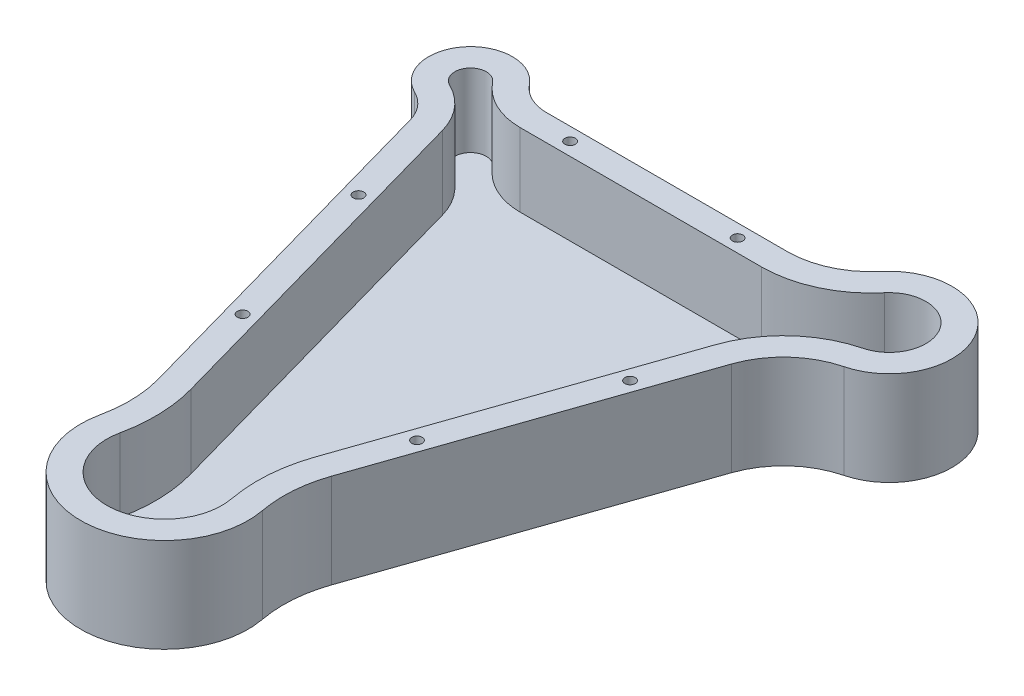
ISO-10303-21;
HEADER;
FILE_DESCRIPTION(('STEP AP214'),'2;1');
FILE_NAME('part.step','',(''),(''),'','','');
FILE_SCHEMA(('AUTOMOTIVE_DESIGN { 1 0 10303 214 1 1 1 1 }'));
ENDSEC;
DATA;
#1=APPLICATION_CONTEXT('core data for automotive mechanical design processes');
#2=APPLICATION_PROTOCOL_DEFINITION('international standard','automotive_design',2000,#1);
#3=PRODUCT_CONTEXT('',#1,'mechanical');
#4=PRODUCT('Part','Part','',(#3));
#5=PRODUCT_RELATED_PRODUCT_CATEGORY('part','',(#4));
#6=PRODUCT_DEFINITION_FORMATION('','',#4);
#7=PRODUCT_DEFINITION_CONTEXT('part definition',#1,'design');
#8=PRODUCT_DEFINITION('design','',#6,#7);
#9=PRODUCT_DEFINITION_SHAPE('','',#8);
#10=(LENGTH_UNIT() NAMED_UNIT(*) SI_UNIT(.MILLI.,.METRE.));
#11=(NAMED_UNIT(*) PLANE_ANGLE_UNIT() SI_UNIT($,.RADIAN.));
#12=(NAMED_UNIT(*) SI_UNIT($,.STERADIAN.) SOLID_ANGLE_UNIT());
#13=UNCERTAINTY_MEASURE_WITH_UNIT(LENGTH_MEASURE(1.E-05),#10,'distance_accuracy_value','');
#14=(GEOMETRIC_REPRESENTATION_CONTEXT(3) GLOBAL_UNCERTAINTY_ASSIGNED_CONTEXT((#13)) GLOBAL_UNIT_ASSIGNED_CONTEXT((#10,
#11,#12)) REPRESENTATION_CONTEXT('',''));
#15=CARTESIAN_POINT('',(0.,0.,0.));
#16=DIRECTION('',(0.,0.,1.));
#17=DIRECTION('',(1.,0.,0.));
#18=AXIS2_PLACEMENT_3D('',#15,#16,#17);
#19=CARTESIAN_POINT('',(-73.1240495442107,12.7,-133.363811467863));
#20=DIRECTION('',(0.,-1.,0.));
#21=DIRECTION('',(0.,0.,-1.));
#22=AXIS2_PLACEMENT_3D('',#19,#20,#21);
#23=CYLINDRICAL_SURFACE('',#22,25.4);
#24=CARTESIAN_POINT('',(-73.1240495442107,0.,-133.363811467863));
#25=DIRECTION('',(0.,-1.,0.));
#26=DIRECTION('',(0.,0.,1.));
#27=AXIS2_PLACEMENT_3D('',#24,#25,#26);
#28=CIRCLE('',#27,25.4);
#29=CARTESIAN_POINT('',(-73.1240495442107,0.,-107.963811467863));
#30=VERTEX_POINT('',#29);
#31=CARTESIAN_POINT('',(-92.9519181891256,0.,-117.488811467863));
#32=VERTEX_POINT('',#31);
#33=EDGE_CURVE('E467',#30,#32,#28,.T.);
#34=ORIENTED_EDGE('',*,*,#33,.T.);
#35=DIRECTION('',(0.,-1.,0.));
#36=VECTOR('',#35,1.);
#37=CARTESIAN_POINT('',(-92.9519181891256,12.7,-117.488811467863));
#38=LINE('',#37,#36);
#39=CARTESIAN_POINT('',(-92.9519181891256,57.15,-117.488811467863));
#40=VERTEX_POINT('',#39);
#41=EDGE_CURVE('E12',#40,#32,#38,.T.);
#42=ORIENTED_EDGE('',*,*,#41,.F.);
#43=CARTESIAN_POINT('',(-73.1240495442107,57.15,-133.363811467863));
#44=DIRECTION('',(0.,-1.,0.));
#45=DIRECTION('',(0.,0.,1.));
#46=AXIS2_PLACEMENT_3D('',#43,#44,#45);
#47=CIRCLE('',#46,25.4);
#48=CARTESIAN_POINT('',(-73.1240495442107,57.15,-107.963811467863));
#49=VERTEX_POINT('',#48);
#50=EDGE_CURVE('E464',#49,#40,#47,.T.);
#51=ORIENTED_EDGE('',*,*,#50,.F.);
#52=DIRECTION('',(0.,-1.,0.));
#53=VECTOR('',#52,1.);
#54=CARTESIAN_POINT('',(-73.1240495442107,12.7,-107.963811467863));
#55=LINE('',#54,#53);
#56=EDGE_CURVE('E492',#49,#30,#55,.T.);
#57=ORIENTED_EDGE('',*,*,#56,.T.);
#58=EDGE_LOOP('',(#34,#42,#51,#57));
#59=FACE_BOUND('',#58,.T.);
#60=ADVANCED_FACE('F98',(#59),#23,.F.);
#61=CARTESIAN_POINT('',(-112.77978683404,12.7,-101.613811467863));
#62=DIRECTION('',(0.,-1.,0.));
#63=DIRECTION('',(0.,0.,-1.));
#64=AXIS2_PLACEMENT_3D('',#61,#62,#63);
#65=CYLINDRICAL_SURFACE('',#64,25.4);
#66=CARTESIAN_POINT('',(-112.77978683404,0.,-101.613811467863));
#67=DIRECTION('',(0.,1.,0.));
#68=DIRECTION('',(0.,0.,-1.));
#69=AXIS2_PLACEMENT_3D('',#66,#67,#68);
#70=CIRCLE('',#69,25.4);
#71=CARTESIAN_POINT('',(-123.873001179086,0.,-78.7642907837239));
#72=VERTEX_POINT('',#71);
#73=EDGE_CURVE('E470',#32,#72,#70,.T.);
#74=ORIENTED_EDGE('',*,*,#73,.T.);
#75=DIRECTION('',(0.,-1.,0.));
#76=VECTOR('',#75,1.);
#77=CARTESIAN_POINT('',(-123.873001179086,12.7,-78.7642907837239));
#78=LINE('',#77,#76);
#79=CARTESIAN_POINT('',(-123.873001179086,57.15,-78.7642907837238));
#80=VERTEX_POINT('',#79);
#81=EDGE_CURVE('E105',#80,#72,#78,.T.);
#82=ORIENTED_EDGE('',*,*,#81,.F.);
#83=CARTESIAN_POINT('',(-112.77978683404,57.15,-101.613811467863));
#84=DIRECTION('',(0.,1.,0.));
#85=DIRECTION('',(0.,0.,1.));
#86=AXIS2_PLACEMENT_3D('',#83,#84,#85);
#87=CIRCLE('',#86,25.4);
#88=EDGE_CURVE('E431',#40,#80,#87,.T.);
#89=ORIENTED_EDGE('',*,*,#88,.F.);
#90=ORIENTED_EDGE('',*,*,#41,.T.);
#91=EDGE_LOOP('',(#74,#82,#89,#90));
#92=FACE_BOUND('',#91,.T.);
#93=ADVANCED_FACE('F572',(#92),#65,.T.);
#94=CARTESIAN_POINT('',(-134.966215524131,12.7,-55.9147700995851));
#95=DIRECTION('',(0.,-1.,0.));
#96=DIRECTION('',(0.,0.,-1.));
#97=AXIS2_PLACEMENT_3D('',#94,#95,#96);
#98=CYLINDRICAL_SURFACE('',#97,25.4);
#99=CARTESIAN_POINT('',(-134.966215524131,0.,-55.9147700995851));
#100=DIRECTION('',(0.,-1.,0.));
#101=DIRECTION('',(0.,0.,-1.));
#102=AXIS2_PLACEMENT_3D('',#99,#100,#101);
#103=CIRCLE('',#102,25.4);
#104=CARTESIAN_POINT('',(-110.513625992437,0.,-62.787241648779));
#105=VERTEX_POINT('',#104);
#106=EDGE_CURVE('E472',#72,#105,#103,.T.);
#107=ORIENTED_EDGE('',*,*,#106,.T.);
#108=DIRECTION('',(0.,-1.,0.));
#109=VECTOR('',#108,1.);
#110=CARTESIAN_POINT('',(-110.513625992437,12.7,-62.787241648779));
#111=LINE('',#110,#109);
#112=CARTESIAN_POINT('',(-110.513625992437,57.15,-62.787241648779));
#113=VERTEX_POINT('',#112);
#114=EDGE_CURVE('E519',#113,#105,#111,.T.);
#115=ORIENTED_EDGE('',*,*,#114,.F.);
#116=CARTESIAN_POINT('',(-134.966215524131,57.15,-55.9147700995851));
#117=DIRECTION('',(0.,-1.,0.));
#118=DIRECTION('',(0.,0.,1.));
#119=AXIS2_PLACEMENT_3D('',#116,#117,#118);
#120=CIRCLE('',#119,25.4);
#121=EDGE_CURVE('E434',#80,#113,#120,.T.);
#122=ORIENTED_EDGE('',*,*,#121,.F.);
#123=ORIENTED_EDGE('',*,*,#81,.T.);
#124=EDGE_LOOP('',(#107,#115,#122,#123));
#125=FACE_BOUND('',#124,.T.);
#126=ADVANCED_FACE('F525',(#125),#98,.F.);
#127=CARTESIAN_POINT('',(-110.513625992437,12.7,-62.787241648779));
#128=DIRECTION('',(0.962700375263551,0.,-0.270569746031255));
#129=DIRECTION('',(-0.270569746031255,0.,-0.962700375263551));
#130=AXIS2_PLACEMENT_3D('',#127,#128,#129);
#131=PLANE('',#130);
#132=DIRECTION('',(0.270569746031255,0.,0.962700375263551));
#133=VECTOR('',#132,1.);
#134=CARTESIAN_POINT('',(-110.513625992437,0.,-62.787241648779));
#135=LINE('',#134,#133);
#136=CARTESIAN_POINT('',(-50.8180578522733,0.,149.612506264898));
#137=VERTEX_POINT('',#136);
#138=EDGE_CURVE('E474',#105,#137,#135,.T.);
#139=ORIENTED_EDGE('',*,*,#138,.T.);
#140=DIRECTION('',(0.,-1.,0.));
#141=VECTOR('',#140,1.);
#142=CARTESIAN_POINT('',(-50.8180578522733,12.7,149.612506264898));
#143=LINE('',#142,#141);
#144=CARTESIAN_POINT('',(-50.8180578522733,57.15,149.612506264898));
#145=VERTEX_POINT('',#144);
#146=EDGE_CURVE('E516',#145,#137,#143,.T.);
#147=ORIENTED_EDGE('',*,*,#146,.F.);
#148=DIRECTION('',(0.270569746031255,0.,0.962700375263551));
#149=VECTOR('',#148,1.);
#150=CARTESIAN_POINT('',(-110.513625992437,57.15,-62.787241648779));
#151=LINE('',#150,#149);
#152=EDGE_CURVE('E437',#113,#145,#151,.T.);
#153=ORIENTED_EDGE('',*,*,#152,.F.);
#154=ORIENTED_EDGE('',*,*,#114,.T.);
#155=EDGE_LOOP('',(#139,#147,#153,#154));
#156=FACE_BOUND('',#155,.T.);
#157=ADVANCED_FACE('F535',(#156),#131,.F.);
#158=CARTESIAN_POINT('',(-124.175826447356,12.7,170.229920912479));
#159=DIRECTION('',(0.,-1.,0.));
#160=DIRECTION('',(0.,0.,-1.));
#161=AXIS2_PLACEMENT_3D('',#158,#159,#160);
#162=CYLINDRICAL_SURFACE('',#161,76.2);
#163=CARTESIAN_POINT('',(-124.175826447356,0.,170.229920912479));
#164=DIRECTION('',(0.,-1.,0.));
#165=DIRECTION('',(0.,0.,1.));
#166=AXIS2_PLACEMENT_3D('',#163,#164,#165);
#167=CIRCLE('',#166,76.2);
#168=CARTESIAN_POINT('',(-49.6703305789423,0.,186.210255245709));
#169=VERTEX_POINT('',#168);
#170=EDGE_CURVE('E476',#137,#169,#167,.T.);
#171=ORIENTED_EDGE('',*,*,#170,.T.);
#172=DIRECTION('',(0.,-1.,0.));
#173=VECTOR('',#172,1.);
#174=CARTESIAN_POINT('',(-49.6703305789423,12.7,186.210255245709));
#175=LINE('',#174,#173);
#176=CARTESIAN_POINT('',(-49.6703305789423,57.15,186.210255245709));
#177=VERTEX_POINT('',#176);
#178=EDGE_CURVE('E513',#177,#169,#175,.T.);
#179=ORIENTED_EDGE('',*,*,#178,.F.);
#180=CARTESIAN_POINT('',(-124.175826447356,57.15,170.229920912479));
#181=DIRECTION('',(0.,-1.,0.));
#182=DIRECTION('',(0.,0.,1.));
#183=AXIS2_PLACEMENT_3D('',#180,#181,#182);
#184=CIRCLE('',#183,76.2);
#185=EDGE_CURVE('E440',#145,#177,#184,.T.);
#186=ORIENTED_EDGE('',*,*,#185,.F.);
#187=ORIENTED_EDGE('',*,*,#146,.T.);
#188=EDGE_LOOP('',(#171,#179,#186,#187));
#189=FACE_BOUND('',#188,.T.);
#190=ADVANCED_FACE('F539',(#189),#162,.F.);
#191=CARTESIAN_POINT('',(0.,12.7,196.863811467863));
#192=DIRECTION('',(0.,-1.,0.));
#193=DIRECTION('',(0.,0.,-1.));
#194=AXIS2_PLACEMENT_3D('',#191,#192,#193);
#195=CYLINDRICAL_SURFACE('',#194,50.8);
#196=CARTESIAN_POINT('',(0.,0.,196.863811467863));
#197=DIRECTION('',(0.,1.,0.));
#198=DIRECTION('',(0.,0.,-1.));
#199=AXIS2_PLACEMENT_3D('',#196,#197,#198);
#200=CIRCLE('',#199,50.8);
#201=CARTESIAN_POINT('',(49.9084233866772,0.,187.388091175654));
#202=VERTEX_POINT('',#201);
#203=EDGE_CURVE('E478',#169,#202,#200,.T.);
#204=ORIENTED_EDGE('',*,*,#203,.T.);
#205=DIRECTION('',(0.,-1.,0.));
#206=VECTOR('',#205,1.);
#207=CARTESIAN_POINT('',(49.9084233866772,12.7,187.388091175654));
#208=LINE('',#207,#206);
#209=CARTESIAN_POINT('',(49.9084233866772,57.15,187.388091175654));
#210=VERTEX_POINT('',#209);
#211=EDGE_CURVE('E510',#210,#202,#208,.T.);
#212=ORIENTED_EDGE('',*,*,#211,.F.);
#213=CARTESIAN_POINT('',(0.,57.15,196.863811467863));
#214=DIRECTION('',(0.,1.,0.));
#215=DIRECTION('',(0.,0.,1.));
#216=AXIS2_PLACEMENT_3D('',#213,#214,#215);
#217=CIRCLE('',#216,50.8);
#218=EDGE_CURVE('E443',#177,#210,#217,.T.);
#219=ORIENTED_EDGE('',*,*,#218,.F.);
#220=ORIENTED_EDGE('',*,*,#178,.T.);
#221=EDGE_LOOP('',(#204,#212,#219,#220));
#222=FACE_BOUND('',#221,.T.);
#223=ADVANCED_FACE('F546',(#222),#195,.T.);
#224=CARTESIAN_POINT('',(124.771058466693,12.7,173.174510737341));
#225=DIRECTION('',(0.,-1.,0.));
#226=DIRECTION('',(0.,0.,-1.));
#227=AXIS2_PLACEMENT_3D('',#224,#225,#226);
#228=CYLINDRICAL_SURFACE('',#227,76.2);
#229=CARTESIAN_POINT('',(124.771058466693,0.,173.174510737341));
#230=DIRECTION('',(0.,-1.,0.));
#231=DIRECTION('',(0.,0.,-1.));
#232=AXIS2_PLACEMENT_3D('',#229,#230,#231);
#233=CIRCLE('',#232,76.2);
#234=CARTESIAN_POINT('',(52.7611943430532,0.,148.254248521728));
#235=VERTEX_POINT('',#234);
#236=EDGE_CURVE('E480',#202,#235,#233,.T.);
#237=ORIENTED_EDGE('',*,*,#236,.T.);
#238=DIRECTION('',(0.,-1.,0.));
#239=VECTOR('',#238,1.);
#240=CARTESIAN_POINT('',(52.7611943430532,12.7,148.254248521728));
#241=LINE('',#240,#239);
#242=CARTESIAN_POINT('',(52.7611943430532,57.15,148.254248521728));
#243=VERTEX_POINT('',#242);
#244=EDGE_CURVE('E507',#243,#235,#241,.T.);
#245=ORIENTED_EDGE('',*,*,#244,.F.);
#246=CARTESIAN_POINT('',(124.771058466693,57.15,173.174510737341));
#247=DIRECTION('',(0.,-1.,0.));
#248=DIRECTION('',(0.,0.,1.));
#249=AXIS2_PLACEMENT_3D('',#246,#247,#248);
#250=CIRCLE('',#249,76.2);
#251=EDGE_CURVE('E446',#210,#243,#250,.T.);
#252=ORIENTED_EDGE('',*,*,#251,.F.);
#253=ORIENTED_EDGE('',*,*,#211,.T.);
#254=EDGE_LOOP('',(#237,#245,#252,#253));
#255=FACE_BOUND('',#254,.T.);
#256=ADVANCED_FACE('F549',(#255),#228,.F.);
#257=CARTESIAN_POINT('',(52.7611943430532,12.7,148.254248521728));
#258=DIRECTION('',(-0.945011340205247,0.,-0.32703756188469));
#259=DIRECTION('',(-0.32703756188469,0.,0.945011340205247));
#260=AXIS2_PLACEMENT_3D('',#257,#258,#259);
#261=PLANE('',#260);
#262=DIRECTION('',(0.32703756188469,0.,-0.945011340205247));
#263=VECTOR('',#262,1.);
#264=CARTESIAN_POINT('',(52.7611943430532,0.,148.254248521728));
#265=LINE('',#264,#263);
#266=CARTESIAN_POINT('',(115.169402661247,0.,-32.0811974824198));
#267=VERTEX_POINT('',#266);
#268=EDGE_CURVE('E482',#235,#267,#265,.T.);
#269=ORIENTED_EDGE('',*,*,#268,.T.);
#270=DIRECTION('',(0.,-1.,0.));
#271=VECTOR('',#270,1.);
#272=CARTESIAN_POINT('',(115.169402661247,12.7,-32.0811974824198));
#273=LINE('',#272,#271);
#274=CARTESIAN_POINT('',(115.169402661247,57.15,-32.0811974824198));
#275=VERTEX_POINT('',#274);
#276=EDGE_CURVE('E504',#275,#267,#273,.T.);
#277=ORIENTED_EDGE('',*,*,#276,.F.);
#278=DIRECTION('',(0.32703756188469,0.,-0.945011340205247));
#279=VECTOR('',#278,1.);
#280=CARTESIAN_POINT('',(52.7611943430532,57.15,148.254248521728));
#281=LINE('',#280,#279);
#282=EDGE_CURVE('E449',#243,#275,#281,.T.);
#283=ORIENTED_EDGE('',*,*,#282,.F.);
#284=ORIENTED_EDGE('',*,*,#244,.T.);
#285=EDGE_LOOP('',(#269,#277,#283,#284));
#286=FACE_BOUND('',#285,.T.);
#287=ADVANCED_FACE('F554',(#286),#261,.F.);
#288=CARTESIAN_POINT('',(163.175978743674,12.7,-15.4676893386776));
#289=DIRECTION('',(0.,-1.,0.));
#290=DIRECTION('',(0.,0.,-1.));
#291=AXIS2_PLACEMENT_3D('',#288,#289,#290);
#292=CYLINDRICAL_SURFACE('',#291,50.8);
#293=CARTESIAN_POINT('',(163.175978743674,0.,-15.4676893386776));
#294=DIRECTION('',(0.,-1.,0.));
#295=DIRECTION('',(0.,0.,1.));
#296=AXIS2_PLACEMENT_3D('',#293,#294,#295);
#297=CIRCLE('',#296,50.8);
#298=CARTESIAN_POINT('',(150.62982698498,0.,-64.694044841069));
#299=VERTEX_POINT('',#298);
#300=EDGE_CURVE('E484',#267,#299,#297,.T.);
#301=ORIENTED_EDGE('',*,*,#300,.T.);
#302=DIRECTION('',(0.,-1.,0.));
#303=VECTOR('',#302,1.);
#304=CARTESIAN_POINT('',(150.62982698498,12.7,-64.694044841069));
#305=LINE('',#304,#303);
#306=CARTESIAN_POINT('',(150.62982698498,57.15,-64.694044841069));
#307=VERTEX_POINT('',#306);
#308=EDGE_CURVE('E501',#307,#299,#305,.T.);
#309=ORIENTED_EDGE('',*,*,#308,.F.);
#310=CARTESIAN_POINT('',(163.175978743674,57.15,-15.4676893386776));
#311=DIRECTION('',(0.,-1.,0.));
#312=DIRECTION('',(0.,0.,1.));
#313=AXIS2_PLACEMENT_3D('',#310,#311,#312);
#314=CIRCLE('',#313,50.8);
#315=EDGE_CURVE('E452',#275,#307,#314,.T.);
#316=ORIENTED_EDGE('',*,*,#315,.F.);
#317=ORIENTED_EDGE('',*,*,#276,.T.);
#318=EDGE_LOOP('',(#301,#309,#316,#317));
#319=FACE_BOUND('',#318,.T.);
#320=ADVANCED_FACE('F558',(#319),#292,.F.);
#321=CARTESIAN_POINT('',(141.22021316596,12.7,-101.613811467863));
#322=DIRECTION('',(0.,-1.,0.));
#323=DIRECTION('',(0.,0.,-1.));
#324=AXIS2_PLACEMENT_3D('',#321,#322,#323);
#325=CYLINDRICAL_SURFACE('',#324,38.1);
#326=CARTESIAN_POINT('',(141.22021316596,0.,-101.613811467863));
#327=DIRECTION('',(0.,1.,0.));
#328=DIRECTION('',(0.,0.,1.));
#329=AXIS2_PLACEMENT_3D('',#326,#327,#328);
#330=CIRCLE('',#329,38.1);
#331=CARTESIAN_POINT('',(112.036143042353,0.,-126.10666861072));
#332=VERTEX_POINT('',#331);
#333=EDGE_CURVE('E486',#299,#332,#330,.T.);
#334=ORIENTED_EDGE('',*,*,#333,.T.);
#335=DIRECTION('',(0.,-1.,0.));
#336=VECTOR('',#335,1.);
#337=CARTESIAN_POINT('',(112.036143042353,12.7,-126.10666861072));
#338=LINE('',#337,#336);
#339=CARTESIAN_POINT('',(112.036143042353,57.15,-126.10666861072));
#340=VERTEX_POINT('',#339);
#341=EDGE_CURVE('E498',#340,#332,#338,.T.);
#342=ORIENTED_EDGE('',*,*,#341,.F.);
#343=CARTESIAN_POINT('',(141.22021316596,57.15,-101.613811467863));
#344=DIRECTION('',(0.,1.,0.));
#345=DIRECTION('',(0.,0.,1.));
#346=AXIS2_PLACEMENT_3D('',#343,#344,#345);
#347=CIRCLE('',#346,38.1);
#348=EDGE_CURVE('E455',#307,#340,#347,.T.);
#349=ORIENTED_EDGE('',*,*,#348,.F.);
#350=ORIENTED_EDGE('',*,*,#308,.T.);
#351=EDGE_LOOP('',(#334,#342,#349,#350));
#352=FACE_BOUND('',#351,.T.);
#353=ADVANCED_FACE('F562',(#352),#325,.T.);
#354=CARTESIAN_POINT('',(73.1240495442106,12.7,-158.763811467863));
#355=DIRECTION('',(0.,-1.,0.));
#356=DIRECTION('',(0.,0.,-1.));
#357=AXIS2_PLACEMENT_3D('',#354,#355,#356);
#358=CYLINDRICAL_SURFACE('',#357,50.8);
#359=CARTESIAN_POINT('',(73.1240495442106,0.,-158.763811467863));
#360=DIRECTION('',(0.,-1.,0.));
#361=DIRECTION('',(0.,0.,-1.));
#362=AXIS2_PLACEMENT_3D('',#359,#360,#361);
#363=CIRCLE('',#362,50.8);
#364=CARTESIAN_POINT('',(73.1240495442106,0.,-107.963811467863));
#365=VERTEX_POINT('',#364);
#366=EDGE_CURVE('E488',#332,#365,#363,.T.);
#367=ORIENTED_EDGE('',*,*,#366,.T.);
#368=DIRECTION('',(0.,-1.,0.));
#369=VECTOR('',#368,1.);
#370=CARTESIAN_POINT('',(73.1240495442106,12.7,-107.963811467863));
#371=LINE('',#370,#369);
#372=CARTESIAN_POINT('',(73.1240495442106,57.15,-107.963811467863));
#373=VERTEX_POINT('',#372);
#374=EDGE_CURVE('E495',#373,#365,#371,.T.);
#375=ORIENTED_EDGE('',*,*,#374,.F.);
#376=CARTESIAN_POINT('',(73.1240495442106,57.15,-158.763811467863));
#377=DIRECTION('',(0.,-1.,0.));
#378=DIRECTION('',(0.,0.,1.));
#379=AXIS2_PLACEMENT_3D('',#376,#377,#378);
#380=CIRCLE('',#379,50.8);
#381=EDGE_CURVE('E458',#340,#373,#380,.T.);
#382=ORIENTED_EDGE('',*,*,#381,.F.);
#383=ORIENTED_EDGE('',*,*,#341,.T.);
#384=EDGE_LOOP('',(#367,#375,#382,#383));
#385=FACE_BOUND('',#384,.T.);
#386=ADVANCED_FACE('F565',(#385),#358,.F.);
#387=CARTESIAN_POINT('',(73.1240495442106,12.7,-107.963811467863));
#388=DIRECTION('',(0.,0.,1.));
#389=DIRECTION('',(1.,0.,0.));
#390=AXIS2_PLACEMENT_3D('',#387,#388,#389);
#391=PLANE('',#390);
#392=DIRECTION('',(-1.,0.,0.));
#393=VECTOR('',#392,1.);
#394=CARTESIAN_POINT('',(73.1240495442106,0.,-107.963811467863));
#395=LINE('',#394,#393);
#396=EDGE_CURVE('E490',#365,#30,#395,.T.);
#397=ORIENTED_EDGE('',*,*,#396,.T.);
#398=ORIENTED_EDGE('',*,*,#56,.F.);
#399=DIRECTION('',(-1.,0.,0.));
#400=VECTOR('',#399,1.);
#401=CARTESIAN_POINT('',(73.1240495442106,57.15,-107.963811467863));
#402=LINE('',#401,#400);
#403=EDGE_CURVE('E461',#373,#49,#402,.T.);
#404=ORIENTED_EDGE('',*,*,#403,.F.);
#405=ORIENTED_EDGE('',*,*,#374,.T.);
#406=EDGE_LOOP('',(#397,#398,#404,#405));
#407=FACE_BOUND('',#406,.T.);
#408=ADVANCED_FACE('F568',(#407),#391,.F.);
#409=CARTESIAN_POINT('',(-73.1240495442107,0.,-133.363811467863));
#410=DIRECTION('',(0.,1.,0.));
#411=DIRECTION('',(0.,0.,1.));
#412=AXIS2_PLACEMENT_3D('',#409,#410,#411);
#413=PLANE('',#412);
#414=ORIENTED_EDGE('',*,*,#33,.F.);
#415=ORIENTED_EDGE('',*,*,#396,.F.);
#416=ORIENTED_EDGE('',*,*,#366,.F.);
#417=ORIENTED_EDGE('',*,*,#333,.F.);
#418=ORIENTED_EDGE('',*,*,#300,.F.);
#419=ORIENTED_EDGE('',*,*,#268,.F.);
#420=ORIENTED_EDGE('',*,*,#236,.F.);
#421=ORIENTED_EDGE('',*,*,#203,.F.);
#422=ORIENTED_EDGE('',*,*,#170,.F.);
#423=ORIENTED_EDGE('',*,*,#138,.F.);
#424=ORIENTED_EDGE('',*,*,#106,.F.);
#425=ORIENTED_EDGE('',*,*,#73,.F.);
#426=EDGE_LOOP('',(#414,#415,#416,#417,#418,#419,#420,#421,#422,#423,#424,#425));
#427=FACE_BOUND('',#426,.T.);
#428=ADVANCED_FACE('F531',(#427),#413,.F.);
#429=CARTESIAN_POINT('',(-112.77978683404,57.15,-101.613811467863));
#430=DIRECTION('',(0.,1.,0.));
#431=DIRECTION('',(0.,0.,1.));
#432=AXIS2_PLACEMENT_3D('',#429,#430,#431);
#433=PLANE('',#432);
#434=CARTESIAN_POINT('',(-50.8,57.15,-100.026311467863));
#435=DIRECTION('',(0.,1.,0.));
#436=DIRECTION('',(0.,0.,1.));
#437=AXIS2_PLACEMENT_3D('',#434,#435,#436);
#438=CIRCLE('',#437,3.175);
#439=CARTESIAN_POINT('',(-50.8,57.15,-96.8513114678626));
#440=VERTEX_POINT('',#439);
#441=EDGE_CURVE('E749',#440,#440,#438,.T.);
#442=ORIENTED_EDGE('',*,*,#441,.F.);
#443=EDGE_LOOP('',(#442));
#444=FACE_BOUND('',#443,.T.);
#445=CARTESIAN_POINT('',(50.8,57.15,-100.026311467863));
#446=DIRECTION('',(0.,1.,0.));
#447=DIRECTION('',(0.,0.,1.));
#448=AXIS2_PLACEMENT_3D('',#445,#446,#447);
#449=CIRCLE('',#448,3.17499999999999);
#450=CARTESIAN_POINT('',(50.8,57.15,-96.8513114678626));
#451=VERTEX_POINT('',#450);
#452=EDGE_CURVE('E282',#451,#451,#449,.T.);
#453=ORIENTED_EDGE('',*,*,#452,.F.);
#454=EDGE_LOOP('',(#453));
#455=FACE_BOUND('',#454,.T.);
#456=CARTESIAN_POINT('',(93.0777791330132,57.15,7.48408878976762));
#457=DIRECTION('',(0.,1.,0.));
#458=DIRECTION('',(0.,0.,1.));
#459=AXIS2_PLACEMENT_3D('',#456,#457,#458);
#460=CIRCLE('',#459,3.175);
#461=CARTESIAN_POINT('',(93.0777791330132,57.15,10.6590887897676));
#462=VERTEX_POINT('',#461);
#463=EDGE_CURVE('E301',#462,#462,#460,.T.);
#464=ORIENTED_EDGE('',*,*,#463,.F.);
#465=EDGE_LOOP('',(#464));
#466=FACE_BOUND('',#465,.T.);
#467=CARTESIAN_POINT('',(59.8507628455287,57.15,103.497240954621));
#468=DIRECTION('',(0.,1.,0.));
#469=DIRECTION('',(0.,0.,1.));
#470=AXIS2_PLACEMENT_3D('',#467,#468,#469);
#471=CIRCLE('',#470,3.17499999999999);
#472=CARTESIAN_POINT('',(59.8507628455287,57.15,106.672240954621));
#473=VERTEX_POINT('',#472);
#474=EDGE_CURVE('E313',#473,#473,#471,.T.);
#475=ORIENTED_EDGE('',*,*,#474,.F.);
#476=EDGE_LOOP('',(#475));
#477=FACE_BOUND('',#476,.T.);
#478=CARTESIAN_POINT('',(-59.2794645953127,57.15,90.1701640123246));
#479=DIRECTION('',(0.,1.,0.));
#480=DIRECTION('',(0.,0.,1.));
#481=AXIS2_PLACEMENT_3D('',#478,#479,#480);
#482=CIRCLE('',#481,3.175);
#483=CARTESIAN_POINT('',(-59.2794645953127,57.15,93.3451640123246));
#484=VERTEX_POINT('',#483);
#485=EDGE_CURVE('E325',#484,#484,#482,.T.);
#486=ORIENTED_EDGE('',*,*,#485,.F.);
#487=EDGE_LOOP('',(#486));
#488=FACE_BOUND('',#487,.T.);
#489=CARTESIAN_POINT('',(-86.7693507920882,57.15,-7.6401941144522));
#490=DIRECTION('',(0.,1.,0.));
#491=DIRECTION('',(0.,0.,1.));
#492=AXIS2_PLACEMENT_3D('',#489,#490,#491);
#493=CIRCLE('',#492,3.175);
#494=CARTESIAN_POINT('',(-86.7693507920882,57.15,-4.4651941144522));
#495=VERTEX_POINT('',#494);
#496=EDGE_CURVE('E337',#495,#495,#493,.T.);
#497=ORIENTED_EDGE('',*,*,#496,.F.);
#498=EDGE_LOOP('',(#497));
#499=FACE_BOUND('',#498,.T.);
#500=ORIENTED_EDGE('',*,*,#88,.T.);
#501=ORIENTED_EDGE('',*,*,#121,.T.);
#502=ORIENTED_EDGE('',*,*,#152,.T.);
#503=ORIENTED_EDGE('',*,*,#185,.T.);
#504=ORIENTED_EDGE('',*,*,#218,.T.);
#505=ORIENTED_EDGE('',*,*,#251,.T.);
#506=ORIENTED_EDGE('',*,*,#282,.T.);
#507=ORIENTED_EDGE('',*,*,#315,.T.);
#508=ORIENTED_EDGE('',*,*,#348,.T.);
#509=ORIENTED_EDGE('',*,*,#381,.T.);
#510=ORIENTED_EDGE('',*,*,#403,.T.);
#511=ORIENTED_EDGE('',*,*,#50,.T.);
#512=EDGE_LOOP('',(#500,#501,#502,#503,#504,#505,#506,#507,#508,#509,#510,#511));
#513=FACE_BOUND('',#512,.T.);
#514=CARTESIAN_POINT('',(-134.966215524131,57.15,-55.9147700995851));
#515=DIRECTION('',(0.,1.,0.));
#516=DIRECTION('',(-1.,0.,0.));
#517=AXIS2_PLACEMENT_3D('',#514,#515,#516);
#518=CIRCLE('',#517,41.275);
#519=CARTESIAN_POINT('',(-116.939742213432,57.15,-93.0452412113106));
#520=VERTEX_POINT('',#519);
#521=CARTESIAN_POINT('',(-95.2307575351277,57.15,-67.0825363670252));
#522=VERTEX_POINT('',#521);
#523=EDGE_CURVE('E373',#520,#522,#518,.F.);
#524=ORIENTED_EDGE('',*,*,#523,.F.);
#525=CARTESIAN_POINT('',(-112.77978683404,57.15,-101.613811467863));
#526=DIRECTION('',(0.,1.,0.));
#527=DIRECTION('',(-1.,0.,0.));
#528=AXIS2_PLACEMENT_3D('',#525,#526,#527);
#529=CIRCLE('',#528,9.52500000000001);
#530=CARTESIAN_POINT('',(-105.344336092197,57.15,-107.566936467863));
#531=VERTEX_POINT('',#530);
#532=EDGE_CURVE('E371',#531,#520,#529,.T.);
#533=ORIENTED_EDGE('',*,*,#532,.F.);
#534=CARTESIAN_POINT('',(-73.1240495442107,57.15,-133.363811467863));
#535=DIRECTION('',(0.,1.,0.));
#536=DIRECTION('',(-1.,0.,0.));
#537=AXIS2_PLACEMENT_3D('',#534,#535,#536);
#538=CIRCLE('',#537,41.275);
#539=CARTESIAN_POINT('',(-73.1240495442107,57.15,-92.0888114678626));
#540=VERTEX_POINT('',#539);
#541=EDGE_CURVE('E394',#540,#531,#538,.F.);
#542=ORIENTED_EDGE('',*,*,#541,.F.);
#543=DIRECTION('',(-1.,0.,0.));
#544=VECTOR('',#543,1.);
#545=CARTESIAN_POINT('',(73.1240495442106,57.15,-92.0888114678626));
#546=LINE('',#545,#544);
#547=CARTESIAN_POINT('',(73.1240495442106,57.15,-92.0888114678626));
#548=VERTEX_POINT('',#547);
#549=EDGE_CURVE('E391',#548,#540,#546,.T.);
#550=ORIENTED_EDGE('',*,*,#549,.F.);
#551=CARTESIAN_POINT('',(73.1240495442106,57.15,-158.763811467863));
#552=DIRECTION('',(0.,1.,0.));
#553=DIRECTION('',(-1.,0.,0.));
#554=AXIS2_PLACEMENT_3D('',#551,#552,#553);
#555=CIRCLE('',#554,66.675);
#556=CARTESIAN_POINT('',(124.196172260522,57.15,-115.901311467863));
#557=VERTEX_POINT('',#556);
#558=EDGE_CURVE('E389',#557,#548,#555,.F.);
#559=ORIENTED_EDGE('',*,*,#558,.F.);
#560=CARTESIAN_POINT('',(141.22021316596,57.15,-101.613811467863));
#561=DIRECTION('',(0.,1.,0.));
#562=DIRECTION('',(-1.,0.,0.));
#563=AXIS2_PLACEMENT_3D('',#560,#561,#562);
#564=CIRCLE('',#563,22.225);
#565=CARTESIAN_POINT('',(146.709154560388,57.15,-80.0772809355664));
#566=VERTEX_POINT('',#565);
#567=EDGE_CURVE('E387',#566,#557,#564,.T.);
#568=ORIENTED_EDGE('',*,*,#567,.F.);
#569=CARTESIAN_POINT('',(163.175978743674,57.15,-15.4676893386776));
#570=DIRECTION('',(0.,1.,0.));
#571=DIRECTION('',(-1.,0.,0.));
#572=AXIS2_PLACEMENT_3D('',#569,#570,#571);
#573=CIRCLE('',#572,66.675);
#574=CARTESIAN_POINT('',(100.167347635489,57.15,-37.2729187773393));
#575=VERTEX_POINT('',#574);
#576=EDGE_CURVE('E385',#575,#566,#573,.F.);
#577=ORIENTED_EDGE('',*,*,#576,.F.);
#578=DIRECTION('',(0.32703756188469,0.,-0.945011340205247));
#579=VECTOR('',#578,1.);
#580=CARTESIAN_POINT('',(37.7591393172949,57.15,143.062527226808));
#581=LINE('',#580,#579);
#582=CARTESIAN_POINT('',(37.7591393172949,57.15,143.062527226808));
#583=VERTEX_POINT('',#582);
#584=EDGE_CURVE('E383',#583,#575,#581,.T.);
#585=ORIENTED_EDGE('',*,*,#584,.F.);
#586=CARTESIAN_POINT('',(124.771058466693,57.15,173.174510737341));
#587=DIRECTION('',(0.,1.,0.));
#588=DIRECTION('',(-1.,0.,0.));
#589=AXIS2_PLACEMENT_3D('',#586,#587,#588);
#590=CIRCLE('',#589,92.075);
#591=CARTESIAN_POINT('',(34.3120410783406,57.15,190.349253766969));
#592=VERTEX_POINT('',#591);
#593=EDGE_CURVE('E381',#592,#583,#590,.F.);
#594=ORIENTED_EDGE('',*,*,#593,.F.);
#595=CARTESIAN_POINT('',(0.,57.15,196.863811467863));
#596=DIRECTION('',(0.,1.,0.));
#597=DIRECTION('',(-1.,0.,0.));
#598=AXIS2_PLACEMENT_3D('',#595,#596,#597);
#599=CIRCLE('',#598,34.925);
#600=CARTESIAN_POINT('',(-34.1483522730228,57.15,189.539491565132));
#601=VERTEX_POINT('',#600);
#602=EDGE_CURVE('E379',#601,#592,#599,.T.);
#603=ORIENTED_EDGE('',*,*,#602,.F.);
#604=CARTESIAN_POINT('',(-124.175826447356,57.15,170.229920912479));
#605=DIRECTION('',(0.,1.,0.));
#606=DIRECTION('',(-1.,0.,0.));
#607=AXIS2_PLACEMENT_3D('',#604,#605,#606);
#608=CIRCLE('',#607,92.075);
#609=CARTESIAN_POINT('',(-35.5351893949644,57.15,145.317211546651));
#610=VERTEX_POINT('',#609);
#611=EDGE_CURVE('E377',#610,#601,#608,.F.);
#612=ORIENTED_EDGE('',*,*,#611,.F.);
#613=DIRECTION('',(0.270569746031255,0.,0.962700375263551));
#614=VECTOR('',#613,1.);
#615=CARTESIAN_POINT('',(-95.2307575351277,57.15,-67.0825363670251));
#616=LINE('',#615,#614);
#617=EDGE_CURVE('E375',#522,#610,#616,.T.);
#618=ORIENTED_EDGE('',*,*,#617,.F.);
#619=EDGE_LOOP('',(#524,#533,#542,#550,#559,#568,#577,#585,#594,#603,#612,#618));
#620=FACE_BOUND('',#619,.T.);
#621=ADVANCED_FACE('F542',(#444,#455,#466,#477,#488,#499,#513,#620),#433,.T.);
#622=CARTESIAN_POINT('',(-112.77978683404,57.15,-101.613811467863));
#623=DIRECTION('',(0.,-1.,0.));
#624=DIRECTION('',(0.,0.,-1.));
#625=AXIS2_PLACEMENT_3D('',#622,#623,#624);
#626=CYLINDRICAL_SURFACE('',#625,9.52500000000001);
#627=CARTESIAN_POINT('',(-112.77978683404,12.7,-101.613811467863));
#628=DIRECTION('',(0.,1.,0.));
#629=DIRECTION('',(-1.,0.,0.));
#630=AXIS2_PLACEMENT_3D('',#627,#628,#629);
#631=CIRCLE('',#630,9.52500000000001);
#632=CARTESIAN_POINT('',(-105.344336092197,12.7,-107.566936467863));
#633=VERTEX_POINT('',#632);
#634=CARTESIAN_POINT('',(-116.939742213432,12.7,-93.0452412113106));
#635=VERTEX_POINT('',#634);
#636=EDGE_CURVE('E112',#633,#635,#631,.T.);
#637=ORIENTED_EDGE('',*,*,#636,.F.);
#638=DIRECTION('',(0.,-1.,0.));
#639=VECTOR('',#638,1.);
#640=CARTESIAN_POINT('',(-105.344336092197,57.15,-107.566936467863));
#641=LINE('',#640,#639);
#642=EDGE_CURVE('E396',#531,#633,#641,.T.);
#643=ORIENTED_EDGE('',*,*,#642,.F.);
#644=ORIENTED_EDGE('',*,*,#532,.T.);
#645=DIRECTION('',(0.,-1.,0.));
#646=VECTOR('',#645,1.);
#647=CARTESIAN_POINT('',(-116.939742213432,57.15,-93.0452412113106));
#648=LINE('',#647,#646);
#649=EDGE_CURVE('E428',#520,#635,#648,.T.);
#650=ORIENTED_EDGE('',*,*,#649,.T.);
#651=EDGE_LOOP('',(#637,#643,#644,#650));
#652=FACE_BOUND('',#651,.T.);
#653=ADVANCED_FACE('F607',(#652),#626,.F.);
#654=CARTESIAN_POINT('',(-134.966215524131,57.15,-55.9147700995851));
#655=DIRECTION('',(0.,-1.,0.));
#656=DIRECTION('',(0.,0.,-1.));
#657=AXIS2_PLACEMENT_3D('',#654,#655,#656);
#658=CYLINDRICAL_SURFACE('',#657,41.275);
#659=CARTESIAN_POINT('',(-134.966215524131,12.7,-55.9147700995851));
#660=DIRECTION('',(0.,1.,0.));
#661=DIRECTION('',(-1.,0.,0.));
#662=AXIS2_PLACEMENT_3D('',#659,#660,#661);
#663=CIRCLE('',#662,41.275);
#664=CARTESIAN_POINT('',(-95.2307575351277,12.7,-67.0825363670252));
#665=VERTEX_POINT('',#664);
#666=EDGE_CURVE('E116',#635,#665,#663,.F.);
#667=ORIENTED_EDGE('',*,*,#666,.F.);
#668=ORIENTED_EDGE('',*,*,#649,.F.);
#669=ORIENTED_EDGE('',*,*,#523,.T.);
#670=DIRECTION('',(0.,-1.,0.));
#671=VECTOR('',#670,1.);
#672=CARTESIAN_POINT('',(-95.2307575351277,57.15,-67.0825363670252));
#673=LINE('',#672,#671);
#674=EDGE_CURVE('E426',#522,#665,#673,.T.);
#675=ORIENTED_EDGE('',*,*,#674,.T.);
#676=EDGE_LOOP('',(#667,#668,#669,#675));
#677=FACE_BOUND('',#676,.T.);
#678=ADVANCED_FACE('F611',(#677),#658,.T.);
#679=CARTESIAN_POINT('',(-95.2307575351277,57.15,-67.0825363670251));
#680=DIRECTION('',(0.962700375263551,0.,-0.270569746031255));
#681=DIRECTION('',(-0.270569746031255,0.,-0.962700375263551));
#682=AXIS2_PLACEMENT_3D('',#679,#680,#681);
#683=PLANE('',#682);
#684=DIRECTION('',(0.270569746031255,0.,0.962700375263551));
#685=VECTOR('',#684,1.);
#686=CARTESIAN_POINT('',(-95.2307575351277,12.7,-67.0825363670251));
#687=LINE('',#686,#685);
#688=CARTESIAN_POINT('',(-35.5351893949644,12.7,145.317211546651));
#689=VERTEX_POINT('',#688);
#690=EDGE_CURVE('E351',#665,#689,#687,.T.);
#691=ORIENTED_EDGE('',*,*,#690,.F.);
#692=ORIENTED_EDGE('',*,*,#674,.F.);
#693=ORIENTED_EDGE('',*,*,#617,.T.);
#694=DIRECTION('',(0.,-1.,0.));
#695=VECTOR('',#694,1.);
#696=CARTESIAN_POINT('',(-35.5351893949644,57.15,145.317211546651));
#697=LINE('',#696,#695);
#698=EDGE_CURVE('E423',#610,#689,#697,.T.);
#699=ORIENTED_EDGE('',*,*,#698,.T.);
#700=EDGE_LOOP('',(#691,#692,#693,#699));
#701=FACE_BOUND('',#700,.T.);
#702=ADVANCED_FACE('F615',(#701),#683,.T.);
#703=CARTESIAN_POINT('',(-124.175826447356,57.15,170.229920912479));
#704=DIRECTION('',(0.,-1.,0.));
#705=DIRECTION('',(0.,0.,-1.));
#706=AXIS2_PLACEMENT_3D('',#703,#704,#705);
#707=CYLINDRICAL_SURFACE('',#706,92.075);
#708=CARTESIAN_POINT('',(-124.175826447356,12.7,170.229920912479));
#709=DIRECTION('',(0.,1.,0.));
#710=DIRECTION('',(-1.,0.,0.));
#711=AXIS2_PLACEMENT_3D('',#708,#709,#710);
#712=CIRCLE('',#711,92.075);
#713=CARTESIAN_POINT('',(-34.1483522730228,12.7,189.539491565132));
#714=VERTEX_POINT('',#713);
#715=EDGE_CURVE('E353',#689,#714,#712,.F.);
#716=ORIENTED_EDGE('',*,*,#715,.F.);
#717=ORIENTED_EDGE('',*,*,#698,.F.);
#718=ORIENTED_EDGE('',*,*,#611,.T.);
#719=DIRECTION('',(0.,-1.,0.));
#720=VECTOR('',#719,1.);
#721=CARTESIAN_POINT('',(-34.1483522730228,57.15,189.539491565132));
#722=LINE('',#721,#720);
#723=EDGE_CURVE('E420',#601,#714,#722,.T.);
#724=ORIENTED_EDGE('',*,*,#723,.T.);
#725=EDGE_LOOP('',(#716,#717,#718,#724));
#726=FACE_BOUND('',#725,.T.);
#727=ADVANCED_FACE('F619',(#726),#707,.T.);
#728=CARTESIAN_POINT('',(0.,57.15,196.863811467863));
#729=DIRECTION('',(0.,-1.,0.));
#730=DIRECTION('',(0.,0.,-1.));
#731=AXIS2_PLACEMENT_3D('',#728,#729,#730);
#732=CYLINDRICAL_SURFACE('',#731,34.925);
#733=CARTESIAN_POINT('',(0.,12.7,196.863811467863));
#734=DIRECTION('',(0.,1.,0.));
#735=DIRECTION('',(-1.,0.,0.));
#736=AXIS2_PLACEMENT_3D('',#733,#734,#735);
#737=CIRCLE('',#736,34.925);
#738=CARTESIAN_POINT('',(34.3120410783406,12.7,190.349253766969));
#739=VERTEX_POINT('',#738);
#740=EDGE_CURVE('E355',#714,#739,#737,.T.);
#741=ORIENTED_EDGE('',*,*,#740,.F.);
#742=ORIENTED_EDGE('',*,*,#723,.F.);
#743=ORIENTED_EDGE('',*,*,#602,.T.);
#744=DIRECTION('',(0.,-1.,0.));
#745=VECTOR('',#744,1.);
#746=CARTESIAN_POINT('',(34.3120410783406,57.15,190.349253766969));
#747=LINE('',#746,#745);
#748=EDGE_CURVE('E417',#592,#739,#747,.T.);
#749=ORIENTED_EDGE('',*,*,#748,.T.);
#750=EDGE_LOOP('',(#741,#742,#743,#749));
#751=FACE_BOUND('',#750,.T.);
#752=ADVANCED_FACE('F623',(#751),#732,.F.);
#753=CARTESIAN_POINT('',(124.771058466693,57.15,173.174510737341));
#754=DIRECTION('',(0.,-1.,0.));
#755=DIRECTION('',(0.,0.,-1.));
#756=AXIS2_PLACEMENT_3D('',#753,#754,#755);
#757=CYLINDRICAL_SURFACE('',#756,92.075);
#758=CARTESIAN_POINT('',(124.771058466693,12.7,173.174510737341));
#759=DIRECTION('',(0.,1.,0.));
#760=DIRECTION('',(-1.,0.,0.));
#761=AXIS2_PLACEMENT_3D('',#758,#759,#760);
#762=CIRCLE('',#761,92.075);
#763=CARTESIAN_POINT('',(37.7591393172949,12.7,143.062527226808));
#764=VERTEX_POINT('',#763);
#765=EDGE_CURVE('E357',#739,#764,#762,.F.);
#766=ORIENTED_EDGE('',*,*,#765,.F.);
#767=ORIENTED_EDGE('',*,*,#748,.F.);
#768=ORIENTED_EDGE('',*,*,#593,.T.);
#769=DIRECTION('',(0.,-1.,0.));
#770=VECTOR('',#769,1.);
#771=CARTESIAN_POINT('',(37.7591393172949,57.15,143.062527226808));
#772=LINE('',#771,#770);
#773=EDGE_CURVE('E414',#583,#764,#772,.T.);
#774=ORIENTED_EDGE('',*,*,#773,.T.);
#775=EDGE_LOOP('',(#766,#767,#768,#774));
#776=FACE_BOUND('',#775,.T.);
#777=ADVANCED_FACE('F627',(#776),#757,.T.);
#778=CARTESIAN_POINT('',(37.7591393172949,57.15,143.062527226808));
#779=DIRECTION('',(-0.945011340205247,0.,-0.32703756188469));
#780=DIRECTION('',(-0.32703756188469,0.,0.945011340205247));
#781=AXIS2_PLACEMENT_3D('',#778,#779,#780);
#782=PLANE('',#781);
#783=DIRECTION('',(0.32703756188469,0.,-0.945011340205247));
#784=VECTOR('',#783,1.);
#785=CARTESIAN_POINT('',(37.7591393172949,12.7,143.062527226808));
#786=LINE('',#785,#784);
#787=CARTESIAN_POINT('',(100.167347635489,12.7,-37.2729187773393));
#788=VERTEX_POINT('',#787);
#789=EDGE_CURVE('E359',#764,#788,#786,.T.);
#790=ORIENTED_EDGE('',*,*,#789,.F.);
#791=ORIENTED_EDGE('',*,*,#773,.F.);
#792=ORIENTED_EDGE('',*,*,#584,.T.);
#793=DIRECTION('',(0.,-1.,0.));
#794=VECTOR('',#793,1.);
#795=CARTESIAN_POINT('',(100.167347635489,57.15,-37.2729187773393));
#796=LINE('',#795,#794);
#797=EDGE_CURVE('E411',#575,#788,#796,.T.);
#798=ORIENTED_EDGE('',*,*,#797,.T.);
#799=EDGE_LOOP('',(#790,#791,#792,#798));
#800=FACE_BOUND('',#799,.T.);
#801=ADVANCED_FACE('F631',(#800),#782,.T.);
#802=CARTESIAN_POINT('',(163.175978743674,57.15,-15.4676893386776));
#803=DIRECTION('',(0.,-1.,0.));
#804=DIRECTION('',(0.,0.,-1.));
#805=AXIS2_PLACEMENT_3D('',#802,#803,#804);
#806=CYLINDRICAL_SURFACE('',#805,66.675);
#807=CARTESIAN_POINT('',(163.175978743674,12.7,-15.4676893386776));
#808=DIRECTION('',(0.,1.,0.));
#809=DIRECTION('',(-1.,0.,0.));
#810=AXIS2_PLACEMENT_3D('',#807,#808,#809);
#811=CIRCLE('',#810,66.675);
#812=CARTESIAN_POINT('',(146.709154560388,12.7,-80.0772809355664));
#813=VERTEX_POINT('',#812);
#814=EDGE_CURVE('E361',#788,#813,#811,.F.);
#815=ORIENTED_EDGE('',*,*,#814,.F.);
#816=ORIENTED_EDGE('',*,*,#797,.F.);
#817=ORIENTED_EDGE('',*,*,#576,.T.);
#818=DIRECTION('',(0.,-1.,0.));
#819=VECTOR('',#818,1.);
#820=CARTESIAN_POINT('',(146.709154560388,57.15,-80.0772809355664));
#821=LINE('',#820,#819);
#822=EDGE_CURVE('E408',#566,#813,#821,.T.);
#823=ORIENTED_EDGE('',*,*,#822,.T.);
#824=EDGE_LOOP('',(#815,#816,#817,#823));
#825=FACE_BOUND('',#824,.T.);
#826=ADVANCED_FACE('F635',(#825),#806,.T.);
#827=CARTESIAN_POINT('',(141.22021316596,57.15,-101.613811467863));
#828=DIRECTION('',(0.,-1.,0.));
#829=DIRECTION('',(0.,0.,-1.));
#830=AXIS2_PLACEMENT_3D('',#827,#828,#829);
#831=CYLINDRICAL_SURFACE('',#830,22.225);
#832=CARTESIAN_POINT('',(141.22021316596,12.7,-101.613811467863));
#833=DIRECTION('',(0.,1.,0.));
#834=DIRECTION('',(-1.,0.,0.));
#835=AXIS2_PLACEMENT_3D('',#832,#833,#834);
#836=CIRCLE('',#835,22.225);
#837=CARTESIAN_POINT('',(124.196172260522,12.7,-115.901311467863));
#838=VERTEX_POINT('',#837);
#839=EDGE_CURVE('E363',#813,#838,#836,.T.);
#840=ORIENTED_EDGE('',*,*,#839,.F.);
#841=ORIENTED_EDGE('',*,*,#822,.F.);
#842=ORIENTED_EDGE('',*,*,#567,.T.);
#843=DIRECTION('',(0.,-1.,0.));
#844=VECTOR('',#843,1.);
#845=CARTESIAN_POINT('',(124.196172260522,57.15,-115.901311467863));
#846=LINE('',#845,#844);
#847=EDGE_CURVE('E405',#557,#838,#846,.T.);
#848=ORIENTED_EDGE('',*,*,#847,.T.);
#849=EDGE_LOOP('',(#840,#841,#842,#848));
#850=FACE_BOUND('',#849,.T.);
#851=ADVANCED_FACE('F639',(#850),#831,.F.);
#852=CARTESIAN_POINT('',(73.1240495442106,57.15,-158.763811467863));
#853=DIRECTION('',(0.,-1.,0.));
#854=DIRECTION('',(0.,0.,-1.));
#855=AXIS2_PLACEMENT_3D('',#852,#853,#854);
#856=CYLINDRICAL_SURFACE('',#855,66.675);
#857=CARTESIAN_POINT('',(73.1240495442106,12.7,-158.763811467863));
#858=DIRECTION('',(0.,1.,0.));
#859=DIRECTION('',(-1.,0.,0.));
#860=AXIS2_PLACEMENT_3D('',#857,#858,#859);
#861=CIRCLE('',#860,66.675);
#862=CARTESIAN_POINT('',(73.1240495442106,12.7,-92.0888114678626));
#863=VERTEX_POINT('',#862);
#864=EDGE_CURVE('E365',#838,#863,#861,.F.);
#865=ORIENTED_EDGE('',*,*,#864,.F.);
#866=ORIENTED_EDGE('',*,*,#847,.F.);
#867=ORIENTED_EDGE('',*,*,#558,.T.);
#868=DIRECTION('',(0.,-1.,0.));
#869=VECTOR('',#868,1.);
#870=CARTESIAN_POINT('',(73.1240495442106,57.15,-92.0888114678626));
#871=LINE('',#870,#869);
#872=EDGE_CURVE('E402',#548,#863,#871,.T.);
#873=ORIENTED_EDGE('',*,*,#872,.T.);
#874=EDGE_LOOP('',(#865,#866,#867,#873));
#875=FACE_BOUND('',#874,.T.);
#876=ADVANCED_FACE('F643',(#875),#856,.T.);
#877=CARTESIAN_POINT('',(73.1240495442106,57.15,-92.0888114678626));
#878=DIRECTION('',(0.,0.,1.));
#879=DIRECTION('',(1.,0.,0.));
#880=AXIS2_PLACEMENT_3D('',#877,#878,#879);
#881=PLANE('',#880);
#882=DIRECTION('',(-1.,0.,0.));
#883=VECTOR('',#882,1.);
#884=CARTESIAN_POINT('',(73.1240495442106,12.7,-92.0888114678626));
#885=LINE('',#884,#883);
#886=CARTESIAN_POINT('',(-73.1240495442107,12.7,-92.0888114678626));
#887=VERTEX_POINT('',#886);
#888=EDGE_CURVE('E367',#863,#887,#885,.T.);
#889=ORIENTED_EDGE('',*,*,#888,.F.);
#890=ORIENTED_EDGE('',*,*,#872,.F.);
#891=ORIENTED_EDGE('',*,*,#549,.T.);
#892=DIRECTION('',(0.,-1.,0.));
#893=VECTOR('',#892,1.);
#894=CARTESIAN_POINT('',(-73.1240495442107,57.15,-92.0888114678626));
#895=LINE('',#894,#893);
#896=EDGE_CURVE('E399',#540,#887,#895,.T.);
#897=ORIENTED_EDGE('',*,*,#896,.T.);
#898=EDGE_LOOP('',(#889,#890,#891,#897));
#899=FACE_BOUND('',#898,.T.);
#900=ADVANCED_FACE('F647',(#899),#881,.T.);
#901=CARTESIAN_POINT('',(-73.1240495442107,57.15,-133.363811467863));
#902=DIRECTION('',(0.,-1.,0.));
#903=DIRECTION('',(0.,0.,-1.));
#904=AXIS2_PLACEMENT_3D('',#901,#902,#903);
#905=CYLINDRICAL_SURFACE('',#904,41.275);
#906=CARTESIAN_POINT('',(-73.1240495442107,12.7,-133.363811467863));
#907=DIRECTION('',(0.,1.,0.));
#908=DIRECTION('',(-1.,0.,0.));
#909=AXIS2_PLACEMENT_3D('',#906,#907,#908);
#910=CIRCLE('',#909,41.275);
#911=EDGE_CURVE('E369',#887,#633,#910,.F.);
#912=ORIENTED_EDGE('',*,*,#911,.F.);
#913=ORIENTED_EDGE('',*,*,#896,.F.);
#914=ORIENTED_EDGE('',*,*,#541,.T.);
#915=ORIENTED_EDGE('',*,*,#642,.T.);
#916=EDGE_LOOP('',(#912,#913,#914,#915));
#917=FACE_BOUND('',#916,.T.);
#918=ADVANCED_FACE('F602',(#917),#905,.T.);
#919=CARTESIAN_POINT('',(-73.1240495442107,12.7,-133.363811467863));
#920=DIRECTION('',(0.,1.,0.));
#921=DIRECTION('',(0.,0.,1.));
#922=AXIS2_PLACEMENT_3D('',#919,#920,#921);
#923=PLANE('',#922);
#924=ORIENTED_EDGE('',*,*,#636,.T.);
#925=ORIENTED_EDGE('',*,*,#666,.T.);
#926=ORIENTED_EDGE('',*,*,#690,.T.);
#927=ORIENTED_EDGE('',*,*,#715,.T.);
#928=ORIENTED_EDGE('',*,*,#740,.T.);
#929=ORIENTED_EDGE('',*,*,#765,.T.);
#930=ORIENTED_EDGE('',*,*,#789,.T.);
#931=ORIENTED_EDGE('',*,*,#814,.T.);
#932=ORIENTED_EDGE('',*,*,#839,.T.);
#933=ORIENTED_EDGE('',*,*,#864,.T.);
#934=ORIENTED_EDGE('',*,*,#888,.T.);
#935=ORIENTED_EDGE('',*,*,#911,.T.);
#936=EDGE_LOOP('',(#924,#925,#926,#927,#928,#929,#930,#931,#932,#933,#934,#935));
#937=FACE_BOUND('',#936,.T.);
#938=ADVANCED_FACE('F598',(#937),#923,.T.);
#939=CARTESIAN_POINT('',(-86.7693507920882,41.7297108,-7.6401941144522));
#940=DIRECTION('',(0.,1.,0.));
#941=DIRECTION('',(0.,0.,1.));
#942=AXIS2_PLACEMENT_3D('',#939,#940,#941);
#943=CONICAL_SURFACE('',#942,2.7051,1.02974425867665);
#944=CARTESIAN_POINT('',(-86.7693507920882,40.1043227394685,-7.6401941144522));
#945=VERTEX_POINT('',#944);
#946=VERTEX_LOOP('',#945);
#947=FACE_BOUND('',#946,.T.);
#948=CARTESIAN_POINT('',(-86.7693507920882,41.7297108,-7.6401941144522));
#949=DIRECTION('',(0.,1.,0.));
#950=DIRECTION('',(0.,0.,1.));
#951=AXIS2_PLACEMENT_3D('',#948,#949,#950);
#952=CIRCLE('',#951,2.7051);
#953=CARTESIAN_POINT('',(-86.7693507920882,41.7297108,-4.9350941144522));
#954=VERTEX_POINT('',#953);
#955=EDGE_CURVE('E346',#954,#954,#952,.T.);
#956=ORIENTED_EDGE('',*,*,#955,.T.);
#957=EDGE_LOOP('',(#956));
#958=FACE_BOUND('',#957,.T.);
#959=ADVANCED_FACE('F601',(#947,#958),#943,.F.);
#960=CARTESIAN_POINT('',(-86.7693507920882,57.15,-7.6401941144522));
#961=DIRECTION('',(0.,1.,0.));
#962=DIRECTION('',(0.,0.,1.));
#963=AXIS2_PLACEMENT_3D('',#960,#961,#962);
#964=CYLINDRICAL_SURFACE('',#963,2.70509999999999);
#965=ORIENTED_EDGE('',*,*,#955,.F.);
#966=EDGE_LOOP('',(#965));
#967=FACE_BOUND('',#966,.T.);
#968=CARTESIAN_POINT('',(-86.7693507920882,44.45,-7.6401941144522));
#969=DIRECTION('',(0.,1.,0.));
#970=DIRECTION('',(0.,0.,1.));
#971=AXIS2_PLACEMENT_3D('',#968,#969,#970);
#972=CIRCLE('',#971,2.70509999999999);
#973=CARTESIAN_POINT('',(-86.7693507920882,44.45,-4.93509411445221));
#974=VERTEX_POINT('',#973);
#975=EDGE_CURVE('E343',#974,#974,#972,.T.);
#976=ORIENTED_EDGE('',*,*,#975,.T.);
#977=EDGE_LOOP('',(#976));
#978=FACE_BOUND('',#977,.T.);
#979=ADVANCED_FACE('F657',(#967,#978),#964,.F.);
#980=CARTESIAN_POINT('',(-84.0642507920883,44.45,-7.6401941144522));
#981=DIRECTION('',(0.,-1.,0.));
#982=DIRECTION('',(0.,0.,-1.));
#983=AXIS2_PLACEMENT_3D('',#980,#981,#982);
#984=PLANE('',#983);
#985=ORIENTED_EDGE('',*,*,#975,.F.);
#986=EDGE_LOOP('',(#985));
#987=FACE_BOUND('',#986,.T.);
#988=CARTESIAN_POINT('',(-86.7693507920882,44.45,-7.6401941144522));
#989=DIRECTION('',(0.,1.,0.));
#990=DIRECTION('',(0.,0.,1.));
#991=AXIS2_PLACEMENT_3D('',#988,#989,#990);
#992=CIRCLE('',#991,3.17499999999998);
#993=CARTESIAN_POINT('',(-86.7693507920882,44.45,-4.46519411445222));
#994=VERTEX_POINT('',#993);
#995=EDGE_CURVE('E340',#994,#994,#992,.T.);
#996=ORIENTED_EDGE('',*,*,#995,.T.);
#997=EDGE_LOOP('',(#996));
#998=FACE_BOUND('',#997,.T.);
#999=ADVANCED_FACE('F661',(#987,#998),#984,.F.);
#1000=CARTESIAN_POINT('',(-86.7693507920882,57.15,-7.6401941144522));
#1001=DIRECTION('',(0.,1.,0.));
#1002=DIRECTION('',(0.,0.,1.));
#1003=AXIS2_PLACEMENT_3D('',#1000,#1001,#1002);
#1004=CYLINDRICAL_SURFACE('',#1003,3.17499999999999);
#1005=ORIENTED_EDGE('',*,*,#995,.F.);
#1006=EDGE_LOOP('',(#1005));
#1007=FACE_BOUND('',#1006,.T.);
#1008=ORIENTED_EDGE('',*,*,#496,.T.);
#1009=EDGE_LOOP('',(#1008));
#1010=FACE_BOUND('',#1009,.T.);
#1011=ADVANCED_FACE('F665',(#1007,#1010),#1004,.F.);
#1012=CARTESIAN_POINT('',(-59.2794645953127,41.7297108,90.1701640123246));
#1013=DIRECTION('',(0.,1.,0.));
#1014=DIRECTION('',(0.,0.,1.));
#1015=AXIS2_PLACEMENT_3D('',#1012,#1013,#1014);
#1016=CONICAL_SURFACE('',#1015,2.70509999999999,1.02974425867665);
#1017=CARTESIAN_POINT('',(-59.2794645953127,40.1043227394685,90.1701640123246));
#1018=VERTEX_POINT('',#1017);
#1019=VERTEX_LOOP('',#1018);
#1020=FACE_BOUND('',#1019,.T.);
#1021=CARTESIAN_POINT('',(-59.2794645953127,41.7297108,90.1701640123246));
#1022=DIRECTION('',(0.,1.,0.));
#1023=DIRECTION('',(0.,0.,1.));
#1024=AXIS2_PLACEMENT_3D('',#1021,#1022,#1023);
#1025=CIRCLE('',#1024,2.70509999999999);
#1026=CARTESIAN_POINT('',(-59.2794645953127,41.7297108,92.8752640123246));
#1027=VERTEX_POINT('',#1026);
#1028=EDGE_CURVE('E334',#1027,#1027,#1025,.T.);
#1029=ORIENTED_EDGE('',*,*,#1028,.T.);
#1030=EDGE_LOOP('',(#1029));
#1031=FACE_BOUND('',#1030,.T.);
#1032=ADVANCED_FACE('F669',(#1020,#1031),#1016,.F.);
#1033=CARTESIAN_POINT('',(-59.2794645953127,57.15,90.1701640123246));
#1034=DIRECTION('',(0.,1.,0.));
#1035=DIRECTION('',(0.,0.,1.));
#1036=AXIS2_PLACEMENT_3D('',#1033,#1034,#1035);
#1037=CYLINDRICAL_SURFACE('',#1036,2.70509999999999);
#1038=ORIENTED_EDGE('',*,*,#1028,.F.);
#1039=EDGE_LOOP('',(#1038));
#1040=FACE_BOUND('',#1039,.T.);
#1041=CARTESIAN_POINT('',(-59.2794645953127,44.45,90.1701640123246));
#1042=DIRECTION('',(0.,1.,0.));
#1043=DIRECTION('',(0.,0.,1.));
#1044=AXIS2_PLACEMENT_3D('',#1041,#1042,#1043);
#1045=CIRCLE('',#1044,2.70509999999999);
#1046=CARTESIAN_POINT('',(-59.2794645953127,44.45,92.8752640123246));
#1047=VERTEX_POINT('',#1046);
#1048=EDGE_CURVE('E331',#1047,#1047,#1045,.T.);
#1049=ORIENTED_EDGE('',*,*,#1048,.T.);
#1050=EDGE_LOOP('',(#1049));
#1051=FACE_BOUND('',#1050,.T.);
#1052=ADVANCED_FACE('F673',(#1040,#1051),#1037,.F.);
#1053=CARTESIAN_POINT('',(-56.5743645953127,44.45,90.1701640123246));
#1054=DIRECTION('',(0.,-1.,0.));
#1055=DIRECTION('',(0.,0.,-1.));
#1056=AXIS2_PLACEMENT_3D('',#1053,#1054,#1055);
#1057=PLANE('',#1056);
#1058=ORIENTED_EDGE('',*,*,#1048,.F.);
#1059=EDGE_LOOP('',(#1058));
#1060=FACE_BOUND('',#1059,.T.);
#1061=CARTESIAN_POINT('',(-59.2794645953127,44.45,90.1701640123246));
#1062=DIRECTION('',(0.,1.,0.));
#1063=DIRECTION('',(0.,0.,1.));
#1064=AXIS2_PLACEMENT_3D('',#1061,#1062,#1063);
#1065=CIRCLE('',#1064,3.17499999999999);
#1066=CARTESIAN_POINT('',(-59.2794645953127,44.45,93.3451640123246));
#1067=VERTEX_POINT('',#1066);
#1068=EDGE_CURVE('E328',#1067,#1067,#1065,.T.);
#1069=ORIENTED_EDGE('',*,*,#1068,.T.);
#1070=EDGE_LOOP('',(#1069));
#1071=FACE_BOUND('',#1070,.T.);
#1072=ADVANCED_FACE('F677',(#1060,#1071),#1057,.F.);
#1073=CARTESIAN_POINT('',(-59.2794645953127,57.15,90.1701640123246));
#1074=DIRECTION('',(0.,1.,0.));
#1075=DIRECTION('',(0.,0.,1.));
#1076=AXIS2_PLACEMENT_3D('',#1073,#1074,#1075);
#1077=CYLINDRICAL_SURFACE('',#1076,3.17499999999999);
#1078=ORIENTED_EDGE('',*,*,#1068,.F.);
#1079=EDGE_LOOP('',(#1078));
#1080=FACE_BOUND('',#1079,.T.);
#1081=ORIENTED_EDGE('',*,*,#485,.T.);
#1082=EDGE_LOOP('',(#1081));
#1083=FACE_BOUND('',#1082,.T.);
#1084=ADVANCED_FACE('F681',(#1080,#1083),#1077,.F.);
#1085=CARTESIAN_POINT('',(59.8507628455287,41.7297108,103.497240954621));
#1086=DIRECTION('',(0.,1.,0.));
#1087=DIRECTION('',(0.,0.,1.));
#1088=AXIS2_PLACEMENT_3D('',#1085,#1086,#1087);
#1089=CONICAL_SURFACE('',#1088,2.70509999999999,1.02974425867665);
#1090=CARTESIAN_POINT('',(59.8507628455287,40.1043227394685,103.497240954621));
#1091=VERTEX_POINT('',#1090);
#1092=VERTEX_LOOP('',#1091);
#1093=FACE_BOUND('',#1092,.T.);
#1094=CARTESIAN_POINT('',(59.8507628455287,41.7297108,103.497240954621));
#1095=DIRECTION('',(0.,1.,0.));
#1096=DIRECTION('',(0.,0.,1.));
#1097=AXIS2_PLACEMENT_3D('',#1094,#1095,#1096);
#1098=CIRCLE('',#1097,2.70509999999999);
#1099=CARTESIAN_POINT('',(59.8507628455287,41.7297108,106.202340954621));
#1100=VERTEX_POINT('',#1099);
#1101=EDGE_CURVE('E322',#1100,#1100,#1098,.T.);
#1102=ORIENTED_EDGE('',*,*,#1101,.T.);
#1103=EDGE_LOOP('',(#1102));
#1104=FACE_BOUND('',#1103,.T.);
#1105=ADVANCED_FACE('F685',(#1093,#1104),#1089,.F.);
#1106=CARTESIAN_POINT('',(59.8507628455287,57.15,103.497240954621));
#1107=DIRECTION('',(0.,1.,0.));
#1108=DIRECTION('',(0.,0.,1.));
#1109=AXIS2_PLACEMENT_3D('',#1106,#1107,#1108);
#1110=CYLINDRICAL_SURFACE('',#1109,2.70509999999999);
#1111=ORIENTED_EDGE('',*,*,#1101,.F.);
#1112=EDGE_LOOP('',(#1111));
#1113=FACE_BOUND('',#1112,.T.);
#1114=CARTESIAN_POINT('',(59.8507628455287,44.45,103.497240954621));
#1115=DIRECTION('',(0.,1.,0.));
#1116=DIRECTION('',(0.,0.,1.));
#1117=AXIS2_PLACEMENT_3D('',#1114,#1115,#1116);
#1118=CIRCLE('',#1117,2.70509999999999);
#1119=CARTESIAN_POINT('',(59.8507628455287,44.45,106.202340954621));
#1120=VERTEX_POINT('',#1119);
#1121=EDGE_CURVE('E319',#1120,#1120,#1118,.T.);
#1122=ORIENTED_EDGE('',*,*,#1121,.T.);
#1123=EDGE_LOOP('',(#1122));
#1124=FACE_BOUND('',#1123,.T.);
#1125=ADVANCED_FACE('F689',(#1113,#1124),#1110,.F.);
#1126=CARTESIAN_POINT('',(62.5558628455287,44.45,103.497240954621));
#1127=DIRECTION('',(0.,-1.,0.));
#1128=DIRECTION('',(0.,0.,-1.));
#1129=AXIS2_PLACEMENT_3D('',#1126,#1127,#1128);
#1130=PLANE('',#1129);
#1131=ORIENTED_EDGE('',*,*,#1121,.F.);
#1132=EDGE_LOOP('',(#1131));
#1133=FACE_BOUND('',#1132,.T.);
#1134=CARTESIAN_POINT('',(59.8507628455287,44.45,103.497240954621));
#1135=DIRECTION('',(0.,1.,0.));
#1136=DIRECTION('',(0.,0.,1.));
#1137=AXIS2_PLACEMENT_3D('',#1134,#1135,#1136);
#1138=CIRCLE('',#1137,3.17499999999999);
#1139=CARTESIAN_POINT('',(59.8507628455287,44.45,106.672240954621));
#1140=VERTEX_POINT('',#1139);
#1141=EDGE_CURVE('E316',#1140,#1140,#1138,.T.);
#1142=ORIENTED_EDGE('',*,*,#1141,.T.);
#1143=EDGE_LOOP('',(#1142));
#1144=FACE_BOUND('',#1143,.T.);
#1145=ADVANCED_FACE('F693',(#1133,#1144),#1130,.F.);
#1146=CARTESIAN_POINT('',(59.8507628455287,57.15,103.497240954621));
#1147=DIRECTION('',(0.,1.,0.));
#1148=DIRECTION('',(0.,0.,1.));
#1149=AXIS2_PLACEMENT_3D('',#1146,#1147,#1148);
#1150=CYLINDRICAL_SURFACE('',#1149,3.17499999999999);
#1151=ORIENTED_EDGE('',*,*,#1141,.F.);
#1152=EDGE_LOOP('',(#1151));
#1153=FACE_BOUND('',#1152,.T.);
#1154=ORIENTED_EDGE('',*,*,#474,.T.);
#1155=EDGE_LOOP('',(#1154));
#1156=FACE_BOUND('',#1155,.T.);
#1157=ADVANCED_FACE('F697',(#1153,#1156),#1150,.F.);
#1158=CARTESIAN_POINT('',(93.0777791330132,41.7297108,7.48408878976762));
#1159=DIRECTION('',(0.,1.,0.));
#1160=DIRECTION('',(0.,0.,1.));
#1161=AXIS2_PLACEMENT_3D('',#1158,#1159,#1160);
#1162=CONICAL_SURFACE('',#1161,2.7051,1.02974425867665);
#1163=CARTESIAN_POINT('',(93.0777791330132,40.1043227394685,7.48408878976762));
#1164=VERTEX_POINT('',#1163);
#1165=VERTEX_LOOP('',#1164);
#1166=FACE_BOUND('',#1165,.T.);
#1167=CARTESIAN_POINT('',(93.0777791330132,41.7297108,7.48408878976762));
#1168=DIRECTION('',(0.,1.,0.));
#1169=DIRECTION('',(0.,0.,1.));
#1170=AXIS2_PLACEMENT_3D('',#1167,#1168,#1169);
#1171=CIRCLE('',#1170,2.7051);
#1172=CARTESIAN_POINT('',(93.0777791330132,41.7297108,10.1891887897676));
#1173=VERTEX_POINT('',#1172);
#1174=EDGE_CURVE('E310',#1173,#1173,#1171,.T.);
#1175=ORIENTED_EDGE('',*,*,#1174,.T.);
#1176=EDGE_LOOP('',(#1175));
#1177=FACE_BOUND('',#1176,.T.);
#1178=ADVANCED_FACE('F701',(#1166,#1177),#1162,.F.);
#1179=CARTESIAN_POINT('',(93.0777791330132,57.15,7.48408878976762));
#1180=DIRECTION('',(0.,1.,0.));
#1181=DIRECTION('',(0.,0.,1.));
#1182=AXIS2_PLACEMENT_3D('',#1179,#1180,#1181);
#1183=CYLINDRICAL_SURFACE('',#1182,2.70509999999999);
#1184=ORIENTED_EDGE('',*,*,#1174,.F.);
#1185=EDGE_LOOP('',(#1184));
#1186=FACE_BOUND('',#1185,.T.);
#1187=CARTESIAN_POINT('',(93.0777791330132,44.45,7.48408878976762));
#1188=DIRECTION('',(0.,1.,0.));
#1189=DIRECTION('',(0.,0.,1.));
#1190=AXIS2_PLACEMENT_3D('',#1187,#1188,#1189);
#1191=CIRCLE('',#1190,2.70509999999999);
#1192=CARTESIAN_POINT('',(93.0777791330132,44.45,10.1891887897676));
#1193=VERTEX_POINT('',#1192);
#1194=EDGE_CURVE('E307',#1193,#1193,#1191,.T.);
#1195=ORIENTED_EDGE('',*,*,#1194,.T.);
#1196=EDGE_LOOP('',(#1195));
#1197=FACE_BOUND('',#1196,.T.);
#1198=ADVANCED_FACE('F705',(#1186,#1197),#1183,.F.);
#1199=CARTESIAN_POINT('',(95.7828791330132,44.45,7.48408878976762));
#1200=DIRECTION('',(0.,-1.,0.));
#1201=DIRECTION('',(0.,0.,-1.));
#1202=AXIS2_PLACEMENT_3D('',#1199,#1200,#1201);
#1203=PLANE('',#1202);
#1204=ORIENTED_EDGE('',*,*,#1194,.F.);
#1205=EDGE_LOOP('',(#1204));
#1206=FACE_BOUND('',#1205,.T.);
#1207=CARTESIAN_POINT('',(93.0777791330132,44.45,7.48408878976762));
#1208=DIRECTION('',(0.,1.,0.));
#1209=DIRECTION('',(0.,0.,1.));
#1210=AXIS2_PLACEMENT_3D('',#1207,#1208,#1209);
#1211=CIRCLE('',#1210,3.17499999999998);
#1212=CARTESIAN_POINT('',(93.0777791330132,44.45,10.6590887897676));
#1213=VERTEX_POINT('',#1212);
#1214=EDGE_CURVE('E304',#1213,#1213,#1211,.T.);
#1215=ORIENTED_EDGE('',*,*,#1214,.T.);
#1216=EDGE_LOOP('',(#1215));
#1217=FACE_BOUND('',#1216,.T.);
#1218=ADVANCED_FACE('F709',(#1206,#1217),#1203,.F.);
#1219=CARTESIAN_POINT('',(93.0777791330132,57.15,7.48408878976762));
#1220=DIRECTION('',(0.,1.,0.));
#1221=DIRECTION('',(0.,0.,1.));
#1222=AXIS2_PLACEMENT_3D('',#1219,#1220,#1221);
#1223=CYLINDRICAL_SURFACE('',#1222,3.17499999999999);
#1224=ORIENTED_EDGE('',*,*,#1214,.F.);
#1225=EDGE_LOOP('',(#1224));
#1226=FACE_BOUND('',#1225,.T.);
#1227=ORIENTED_EDGE('',*,*,#463,.T.);
#1228=EDGE_LOOP('',(#1227));
#1229=FACE_BOUND('',#1228,.T.);
#1230=ADVANCED_FACE('F713',(#1226,#1229),#1223,.F.);
#1231=CARTESIAN_POINT('',(50.8,41.7297108,-100.026311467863));
#1232=DIRECTION('',(0.,1.,0.));
#1233=DIRECTION('',(0.,0.,1.));
#1234=AXIS2_PLACEMENT_3D('',#1231,#1232,#1233);
#1235=CONICAL_SURFACE('',#1234,2.70509999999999,1.02974425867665);
#1236=CARTESIAN_POINT('',(50.8,40.1043227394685,-100.026311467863));
#1237=VERTEX_POINT('',#1236);
#1238=VERTEX_LOOP('',#1237);
#1239=FACE_BOUND('',#1238,.T.);
#1240=CARTESIAN_POINT('',(50.8,41.7297108,-100.026311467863));
#1241=DIRECTION('',(0.,1.,0.));
#1242=DIRECTION('',(0.,0.,1.));
#1243=AXIS2_PLACEMENT_3D('',#1240,#1241,#1242);
#1244=CIRCLE('',#1243,2.70509999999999);
#1245=CARTESIAN_POINT('',(50.8,41.7297108,-97.3212114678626));
#1246=VERTEX_POINT('',#1245);
#1247=EDGE_CURVE('E298',#1246,#1246,#1244,.T.);
#1248=ORIENTED_EDGE('',*,*,#1247,.T.);
#1249=EDGE_LOOP('',(#1248));
#1250=FACE_BOUND('',#1249,.T.);
#1251=ADVANCED_FACE('F717',(#1239,#1250),#1235,.F.);
#1252=CARTESIAN_POINT('',(50.8,57.15,-100.026311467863));
#1253=DIRECTION('',(0.,1.,0.));
#1254=DIRECTION('',(0.,0.,1.));
#1255=AXIS2_PLACEMENT_3D('',#1252,#1253,#1254);
#1256=CYLINDRICAL_SURFACE('',#1255,2.70509999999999);
#1257=ORIENTED_EDGE('',*,*,#1247,.F.);
#1258=EDGE_LOOP('',(#1257));
#1259=FACE_BOUND('',#1258,.T.);
#1260=CARTESIAN_POINT('',(50.8,44.45,-100.026311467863));
#1261=DIRECTION('',(0.,1.,0.));
#1262=DIRECTION('',(0.,0.,1.));
#1263=AXIS2_PLACEMENT_3D('',#1260,#1261,#1262);
#1264=CIRCLE('',#1263,2.70509999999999);
#1265=CARTESIAN_POINT('',(50.8,44.45,-97.3212114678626));
#1266=VERTEX_POINT('',#1265);
#1267=EDGE_CURVE('E295',#1266,#1266,#1264,.T.);
#1268=ORIENTED_EDGE('',*,*,#1267,.T.);
#1269=EDGE_LOOP('',(#1268));
#1270=FACE_BOUND('',#1269,.T.);
#1271=ADVANCED_FACE('F721',(#1259,#1270),#1256,.F.);
#1272=CARTESIAN_POINT('',(53.5051,44.45,-100.026311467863));
#1273=DIRECTION('',(0.,-1.,0.));
#1274=DIRECTION('',(0.,0.,-1.));
#1275=AXIS2_PLACEMENT_3D('',#1272,#1273,#1274);
#1276=PLANE('',#1275);
#1277=ORIENTED_EDGE('',*,*,#1267,.F.);
#1278=EDGE_LOOP('',(#1277));
#1279=FACE_BOUND('',#1278,.T.);
#1280=CARTESIAN_POINT('',(50.8,44.45,-100.026311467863));
#1281=DIRECTION('',(0.,1.,0.));
#1282=DIRECTION('',(0.,0.,1.));
#1283=AXIS2_PLACEMENT_3D('',#1280,#1281,#1282);
#1284=CIRCLE('',#1283,3.17499999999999);
#1285=CARTESIAN_POINT('',(50.8,44.45,-96.8513114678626));
#1286=VERTEX_POINT('',#1285);
#1287=EDGE_CURVE('E286',#1286,#1286,#1284,.T.);
#1288=ORIENTED_EDGE('',*,*,#1287,.T.);
#1289=EDGE_LOOP('',(#1288));
#1290=FACE_BOUND('',#1289,.T.);
#1291=ADVANCED_FACE('F725',(#1279,#1290),#1276,.F.);
#1292=CARTESIAN_POINT('',(50.8,57.15,-100.026311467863));
#1293=DIRECTION('',(0.,1.,0.));
#1294=DIRECTION('',(0.,0.,1.));
#1295=AXIS2_PLACEMENT_3D('',#1292,#1293,#1294);
#1296=CYLINDRICAL_SURFACE('',#1295,3.17499999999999);
#1297=ORIENTED_EDGE('',*,*,#1287,.F.);
#1298=EDGE_LOOP('',(#1297));
#1299=FACE_BOUND('',#1298,.T.);
#1300=ORIENTED_EDGE('',*,*,#452,.T.);
#1301=EDGE_LOOP('',(#1300));
#1302=FACE_BOUND('',#1301,.T.);
#1303=ADVANCED_FACE('F276',(#1299,#1302),#1296,.F.);
#1304=CARTESIAN_POINT('',(-50.8,41.7297108,-100.026311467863));
#1305=DIRECTION('',(0.,1.,0.));
#1306=DIRECTION('',(0.,0.,1.));
#1307=AXIS2_PLACEMENT_3D('',#1304,#1305,#1306);
#1308=CONICAL_SURFACE('',#1307,2.70509999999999,1.02974425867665);
#1309=CARTESIAN_POINT('',(-50.8,40.1043227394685,-100.026311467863));
#1310=VERTEX_POINT('',#1309);
#1311=VERTEX_LOOP('',#1310);
#1312=FACE_BOUND('',#1311,.T.);
#1313=CARTESIAN_POINT('',(-50.8,41.7297108,-100.026311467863));
#1314=DIRECTION('',(0.,1.,0.));
#1315=DIRECTION('',(0.,0.,1.));
#1316=AXIS2_PLACEMENT_3D('',#1313,#1314,#1315);
#1317=CIRCLE('',#1316,2.70509999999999);
#1318=CARTESIAN_POINT('',(-50.8,41.7297108,-97.3212114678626));
#1319=VERTEX_POINT('',#1318);
#1320=EDGE_CURVE('E280',#1319,#1319,#1317,.T.);
#1321=ORIENTED_EDGE('',*,*,#1320,.T.);
#1322=EDGE_LOOP('',(#1321));
#1323=FACE_BOUND('',#1322,.T.);
#1324=ADVANCED_FACE('F272',(#1312,#1323),#1308,.F.);
#1325=CARTESIAN_POINT('',(-50.8,57.15,-100.026311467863));
#1326=DIRECTION('',(0.,1.,0.));
#1327=DIRECTION('',(0.,0.,1.));
#1328=AXIS2_PLACEMENT_3D('',#1325,#1326,#1327);
#1329=CYLINDRICAL_SURFACE('',#1328,2.70509999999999);
#1330=ORIENTED_EDGE('',*,*,#1320,.F.);
#1331=EDGE_LOOP('',(#1330));
#1332=FACE_BOUND('',#1331,.T.);
#1333=CARTESIAN_POINT('',(-50.8,44.45,-100.026311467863));
#1334=DIRECTION('',(0.,1.,0.));
#1335=DIRECTION('',(0.,0.,1.));
#1336=AXIS2_PLACEMENT_3D('',#1333,#1334,#1335);
#1337=CIRCLE('',#1336,2.70509999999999);
#1338=CARTESIAN_POINT('',(-50.8,44.45,-97.3212114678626));
#1339=VERTEX_POINT('',#1338);
#1340=EDGE_CURVE('E283',#1339,#1339,#1337,.T.);
#1341=ORIENTED_EDGE('',*,*,#1340,.T.);
#1342=EDGE_LOOP('',(#1341));
#1343=FACE_BOUND('',#1342,.T.);
#1344=ADVANCED_FACE('F275',(#1332,#1343),#1329,.F.);
#1345=CARTESIAN_POINT('',(-48.0949,44.45,-100.026311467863));
#1346=DIRECTION('',(0.,-1.,0.));
#1347=DIRECTION('',(0.,0.,-1.));
#1348=AXIS2_PLACEMENT_3D('',#1345,#1346,#1347);
#1349=PLANE('',#1348);
#1350=ORIENTED_EDGE('',*,*,#1340,.F.);
#1351=EDGE_LOOP('',(#1350));
#1352=FACE_BOUND('',#1351,.T.);
#1353=CARTESIAN_POINT('',(-50.8,44.45,-100.026311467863));
#1354=DIRECTION('',(0.,1.,0.));
#1355=DIRECTION('',(0.,0.,1.));
#1356=AXIS2_PLACEMENT_3D('',#1353,#1354,#1355);
#1357=CIRCLE('',#1356,3.17499999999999);
#1358=CARTESIAN_POINT('',(-50.8,44.45,-96.8513114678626));
#1359=VERTEX_POINT('',#1358);
#1360=EDGE_CURVE('E289',#1359,#1359,#1357,.T.);
#1361=ORIENTED_EDGE('',*,*,#1360,.T.);
#1362=EDGE_LOOP('',(#1361));
#1363=FACE_BOUND('',#1362,.T.);
#1364=ADVANCED_FACE('F735',(#1352,#1363),#1349,.F.);
#1365=CARTESIAN_POINT('',(-50.8,57.15,-100.026311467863));
#1366=DIRECTION('',(0.,1.,0.));
#1367=DIRECTION('',(0.,0.,1.));
#1368=AXIS2_PLACEMENT_3D('',#1365,#1366,#1367);
#1369=CYLINDRICAL_SURFACE('',#1368,3.17499999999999);
#1370=ORIENTED_EDGE('',*,*,#1360,.F.);
#1371=EDGE_LOOP('',(#1370));
#1372=FACE_BOUND('',#1371,.T.);
#1373=ORIENTED_EDGE('',*,*,#441,.T.);
#1374=EDGE_LOOP('',(#1373));
#1375=FACE_BOUND('',#1374,.T.);
#1376=ADVANCED_FACE('F738',(#1372,#1375),#1369,.F.);
#1377=CLOSED_SHELL('',(#60,#93,#126,#157,#190,#223,#256,#287,#320,#353,#386,#408,#428,#621,#653,
#678,#702,#727,#752,#777,#801,#826,#851,#876,#900,#918,#938,#959,#979,#999,#1011,#1032,#1052,
#1072,#1084,#1105,#1125,#1145,#1157,#1178,#1198,#1218,#1230,#1251,#1271,#1291,#1303,#1324,#1344,
#1364,#1376));
#1378=MANIFOLD_SOLID_BREP('B2',#1377);
#1379=ADVANCED_BREP_SHAPE_REPRESENTATION('',(#18,#1378),#14);
#1380=SHAPE_DEFINITION_REPRESENTATION(#9,#1379);
ENDSEC;
END-ISO-10303-21;
